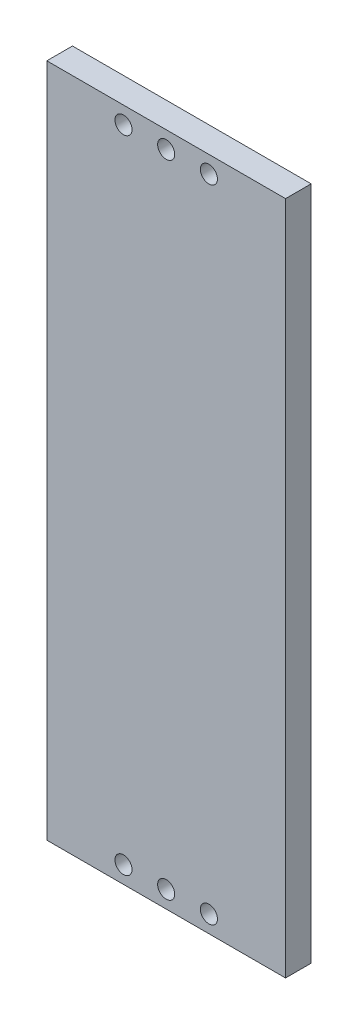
from build123d import *

# Parameters (mm, degrees)
CROQUIS1_W              = 27.94
CROQUIS1_H              = 79
CROQUIS1_R              = 1
SALIENTE_EXTRUIR2_DEPTH = 3


with BuildPart() as part:
    # Croquis1 → Saliente-Extruir2 (new body)
    with BuildSketch(Plane.XY):
        with Locations((0, -28.5)):
            Rectangle(CROQUIS1_W, CROQUIS1_H)
        with Locations((0, -66)):
            Circle(CROQUIS1_R, mode=Mode.SUBTRACT)
        with Locations((5, -66)):
            Circle(CROQUIS1_R, mode=Mode.SUBTRACT)
        with Locations((-5, -66)):
            Circle(CROQUIS1_R, mode=Mode.SUBTRACT)
        with Locations(Location((5, 9, 0), (0, 0, 180))):
            Circle(CROQUIS1_R, mode=Mode.SUBTRACT)
        with Locations(Location((0, 9, 0), (0, 0, 180))):
            Circle(CROQUIS1_R, mode=Mode.SUBTRACT)
        with Locations(Location((-5, 9, 0), (0, 0, 180))):
            Circle(CROQUIS1_R, mode=Mode.SUBTRACT)
    extrude(amount=SALIENTE_EXTRUIR2_DEPTH)


solid = part.part
